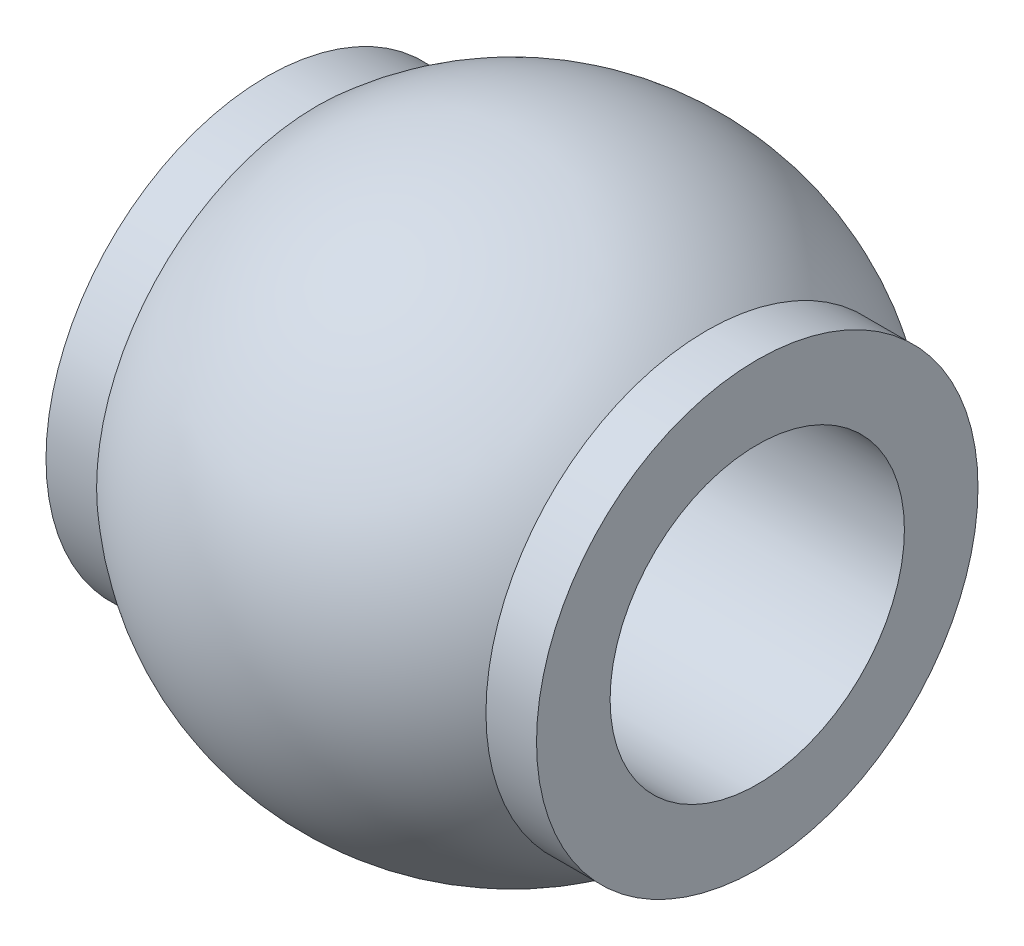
ISO-10303-21;
HEADER;
FILE_DESCRIPTION(('STEP AP214'),'2;1');
FILE_NAME('part.step','',(''),(''),'','','');
FILE_SCHEMA(('AUTOMOTIVE_DESIGN { 1 0 10303 214 1 1 1 1 }'));
ENDSEC;
DATA;
#1=APPLICATION_CONTEXT('core data for automotive mechanical design processes');
#2=APPLICATION_PROTOCOL_DEFINITION('international standard','automotive_design',2000,#1);
#3=PRODUCT_CONTEXT('',#1,'mechanical');
#4=PRODUCT('Part','Part','',(#3));
#5=PRODUCT_RELATED_PRODUCT_CATEGORY('part','',(#4));
#6=PRODUCT_DEFINITION_FORMATION('','',#4);
#7=PRODUCT_DEFINITION_CONTEXT('part definition',#1,'design');
#8=PRODUCT_DEFINITION('design','',#6,#7);
#9=PRODUCT_DEFINITION_SHAPE('','',#8);
#10=(LENGTH_UNIT() NAMED_UNIT(*) SI_UNIT(.MILLI.,.METRE.));
#11=(NAMED_UNIT(*) PLANE_ANGLE_UNIT() SI_UNIT($,.RADIAN.));
#12=(NAMED_UNIT(*) SI_UNIT($,.STERADIAN.) SOLID_ANGLE_UNIT());
#13=UNCERTAINTY_MEASURE_WITH_UNIT(LENGTH_MEASURE(1.E-05),#10,'distance_accuracy_value','');
#14=(GEOMETRIC_REPRESENTATION_CONTEXT(3) GLOBAL_UNCERTAINTY_ASSIGNED_CONTEXT((#13)) GLOBAL_UNIT_ASSIGNED_CONTEXT((#10,
#11,#12)) REPRESENTATION_CONTEXT('',''));
#15=CARTESIAN_POINT('',(0.,0.,0.));
#16=DIRECTION('',(0.,0.,1.));
#17=DIRECTION('',(1.,0.,0.));
#18=AXIS2_PLACEMENT_3D('',#15,#16,#17);
#19=CARTESIAN_POINT('',(-2.5,0.,0.));
#20=DIRECTION('',(1.,0.,0.));
#21=DIRECTION('',(0.,0.,-1.));
#22=AXIS2_PLACEMENT_3D('',#19,#20,#21);
#23=PLANE('',#22);
#24=CARTESIAN_POINT('',(-2.5,0.,0.));
#25=DIRECTION('',(1.,0.,0.));
#26=DIRECTION('',(0.,0.,-1.));
#27=AXIS2_PLACEMENT_3D('',#24,#25,#26);
#28=CIRCLE('',#27,1.5);
#29=CARTESIAN_POINT('',(-2.5,0.,-1.5));
#30=VERTEX_POINT('',#29);
#31=EDGE_CURVE('E367',#30,#30,#28,.T.);
#32=ORIENTED_EDGE('',*,*,#31,.T.);
#33=EDGE_LOOP('',(#32));
#34=FACE_BOUND('',#33,.T.);
#35=CARTESIAN_POINT('',(-2.5,0.,0.));
#36=DIRECTION('',(-1.,0.,0.));
#37=DIRECTION('',(0.,0.,1.));
#38=AXIS2_PLACEMENT_3D('',#35,#36,#37);
#39=CIRCLE('',#38,2.25);
#40=CARTESIAN_POINT('',(-2.5,0.,2.25));
#41=VERTEX_POINT('',#40);
#42=EDGE_CURVE('E362',#41,#41,#39,.T.);
#43=ORIENTED_EDGE('',*,*,#42,.T.);
#44=EDGE_LOOP('',(#43));
#45=FACE_BOUND('',#44,.T.);
#46=ADVANCED_FACE('F348',(#34,#45),#23,.F.);
#47=CARTESIAN_POINT('',(2.5,0.,0.));
#48=DIRECTION('',(-1.,0.,0.));
#49=DIRECTION('',(0.,0.,1.));
#50=AXIS2_PLACEMENT_3D('',#47,#48,#49);
#51=PLANE('',#50);
#52=CARTESIAN_POINT('',(2.5,0.,0.));
#53=DIRECTION('',(1.,0.,0.));
#54=DIRECTION('',(0.,0.,-1.));
#55=AXIS2_PLACEMENT_3D('',#52,#53,#54);
#56=CIRCLE('',#55,1.5);
#57=CARTESIAN_POINT('',(2.5,0.,-1.5));
#58=VERTEX_POINT('',#57);
#59=EDGE_CURVE('E370',#58,#58,#56,.T.);
#60=ORIENTED_EDGE('',*,*,#59,.F.);
#61=EDGE_LOOP('',(#60));
#62=FACE_BOUND('',#61,.T.);
#63=CARTESIAN_POINT('',(2.5,0.,0.));
#64=DIRECTION('',(-1.,0.,0.));
#65=DIRECTION('',(0.,0.,1.));
#66=AXIS2_PLACEMENT_3D('',#63,#64,#65);
#67=CIRCLE('',#66,2.25);
#68=CARTESIAN_POINT('',(2.5,0.,2.25));
#69=VERTEX_POINT('',#68);
#70=EDGE_CURVE('E10',#69,#69,#67,.T.);
#71=ORIENTED_EDGE('',*,*,#70,.F.);
#72=EDGE_LOOP('',(#71));
#73=FACE_BOUND('',#72,.T.);
#74=ADVANCED_FACE('F376',(#62,#73),#51,.F.);
#75=CARTESIAN_POINT('',(-3.63983554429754,0.,0.));
#76=DIRECTION('',(-1.,0.,0.));
#77=DIRECTION('',(0.,0.,1.));
#78=AXIS2_PLACEMENT_3D('',#75,#76,#77);
#79=CYLINDRICAL_SURFACE('',#78,2.25);
#80=CARTESIAN_POINT('',(1.98431348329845,0.,0.));
#81=DIRECTION('',(-1.,0.,0.));
#82=DIRECTION('',(0.,0.,1.));
#83=AXIS2_PLACEMENT_3D('',#80,#81,#82);
#84=CIRCLE('',#83,2.25);
#85=CARTESIAN_POINT('',(1.98431348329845,2.25,0.));
#86=VERTEX_POINT('',#85);
#87=EDGE_CURVE('E354',#86,#86,#84,.T.);
#88=ORIENTED_EDGE('',*,*,#87,.F.);
#89=EDGE_LOOP('',(#88));
#90=FACE_BOUND('',#89,.T.);
#91=ORIENTED_EDGE('',*,*,#70,.T.);
#92=EDGE_LOOP('',(#91));
#93=FACE_BOUND('',#92,.T.);
#94=ADVANCED_FACE('F379',(#90,#93),#79,.T.);
#95=CARTESIAN_POINT('',(0.,0.,0.));
#96=DIRECTION('',(-1.,0.,0.));
#97=DIRECTION('',(0.,1.,0.));
#98=AXIS2_PLACEMENT_3D('',#95,#96,#97);
#99=SPHERICAL_SURFACE('',#98,3.);
#100=CARTESIAN_POINT('',(-1.98431348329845,0.,0.));
#101=DIRECTION('',(-1.,0.,0.));
#102=DIRECTION('',(0.,0.,1.));
#103=AXIS2_PLACEMENT_3D('',#100,#101,#102);
#104=CIRCLE('',#103,2.25);
#105=CARTESIAN_POINT('',(-1.98431348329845,2.25,0.));
#106=VERTEX_POINT('',#105);
#107=EDGE_CURVE('E358',#106,#106,#104,.T.);
#108=CARTESIAN_POINT('',(-1.98431348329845,2.25,0.));
#109=CARTESIAN_POINT('',(-1.95043578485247,2.27987831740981,0.));
#110=CARTESIAN_POINT('',(-1.91588235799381,2.30899034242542,0.));
#111=CARTESIAN_POINT('',(-1.84549659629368,2.36562497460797,0.));
#112=CARTESIAN_POINT('',(-1.80966426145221,2.39314758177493,0.));
#113=CARTESIAN_POINT('',(-1.73679323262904,2.44654654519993,0.));
#114=CARTESIAN_POINT('',(-1.69975453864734,2.47242290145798,0.));
#115=CARTESIAN_POINT('',(-1.62454650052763,2.52247675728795,0.));
#116=CARTESIAN_POINT('',(-1.58637715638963,2.54665425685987,0.));
#117=CARTESIAN_POINT('',(-1.50898564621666,2.59326102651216,0.));
#118=CARTESIAN_POINT('',(-1.46976348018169,2.61569029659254,0.));
#119=CARTESIAN_POINT('',(-1.39034635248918,2.65875486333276,0.));
#120=CARTESIAN_POINT('',(-1.35015139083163,2.67939015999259,0.));
#121=CARTESIAN_POINT('',(-1.26887066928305,2.71882467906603,0.));
#122=CARTESIAN_POINT('',(-1.22778490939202,2.73762390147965,0.));
#123=CARTESIAN_POINT('',(-1.14480640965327,2.77334792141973,0.));
#124=CARTESIAN_POINT('',(-1.10291366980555,2.79027271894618,0.));
#125=CARTESIAN_POINT('',(-1.01840667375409,2.82221336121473,0.));
#126=CARTESIAN_POINT('',(-0.975792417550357,2.83722920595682,0.));
#127=CARTESIAN_POINT('',(-0.889929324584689,2.86532130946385,0.));
#128=CARTESIAN_POINT('',(-0.846680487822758,2.87839756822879,0.));
#129=CARTESIAN_POINT('',(-0.759636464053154,2.90258382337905,0.));
#130=CARTESIAN_POINT('',(-0.715841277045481,2.91369381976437,0.));
#131=CARTESIAN_POINT('',(-0.62779389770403,2.93392488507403,0.));
#132=CARTESIAN_POINT('',(-0.583541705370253,2.94304595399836,0.));
#133=CARTESIAN_POINT('',(-0.494670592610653,2.9592805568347,0.));
#134=CARTESIAN_POINT('',(-0.45005167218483,2.96639409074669,0.));
#135=CARTESIAN_POINT('',(-0.360538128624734,2.9785991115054,0.));
#136=CARTESIAN_POINT('',(-0.315643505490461,2.98369059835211,0.));
#137=CARTESIAN_POINT('',(-0.225670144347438,2.99184113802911,0.));
#138=CARTESIAN_POINT('',(-0.18059140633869,2.99490019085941,0.));
#139=CARTESIAN_POINT('',(-0.0903417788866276,2.99897962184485,0.));
#140=CARTESIAN_POINT('',(-0.0451708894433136,3.,0.));
#141=CARTESIAN_POINT('',(0.0451708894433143,3.,0.));
#142=CARTESIAN_POINT('',(0.0903417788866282,2.99897962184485,0.));
#143=CARTESIAN_POINT('',(0.180591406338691,2.99490019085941,0.));
#144=CARTESIAN_POINT('',(0.225670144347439,2.99184113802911,0.));
#145=CARTESIAN_POINT('',(0.315643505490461,2.98369059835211,0.));
#146=CARTESIAN_POINT('',(0.360538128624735,2.9785991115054,0.));
#147=CARTESIAN_POINT('',(0.450051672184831,2.96639409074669,0.));
#148=CARTESIAN_POINT('',(0.494670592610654,2.95928055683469,0.));
#149=CARTESIAN_POINT('',(0.583541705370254,2.94304595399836,0.));
#150=CARTESIAN_POINT('',(0.627793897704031,2.93392488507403,0.));
#151=CARTESIAN_POINT('',(0.715841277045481,2.91369381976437,0.));
#152=CARTESIAN_POINT('',(0.759636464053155,2.90258382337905,0.));
#153=CARTESIAN_POINT('',(0.846680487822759,2.87839756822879,0.));
#154=CARTESIAN_POINT('',(0.889929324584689,2.86532130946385,0.));
#155=CARTESIAN_POINT('',(0.975792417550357,2.83722920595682,0.));
#156=CARTESIAN_POINT('',(1.01840667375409,2.82221336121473,0.));
#157=CARTESIAN_POINT('',(1.10291366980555,2.79027271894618,0.));
#158=CARTESIAN_POINT('',(1.14480640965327,2.77334792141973,0.));
#159=CARTESIAN_POINT('',(1.22778490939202,2.73762390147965,0.));
#160=CARTESIAN_POINT('',(1.26887066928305,2.71882467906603,0.));
#161=CARTESIAN_POINT('',(1.35015139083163,2.67939015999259,0.));
#162=CARTESIAN_POINT('',(1.39034635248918,2.65875486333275,0.));
#163=CARTESIAN_POINT('',(1.4697634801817,2.61569029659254,0.));
#164=CARTESIAN_POINT('',(1.50898564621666,2.59326102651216,0.));
#165=CARTESIAN_POINT('',(1.58637715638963,2.54665425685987,0.));
#166=CARTESIAN_POINT('',(1.62454650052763,2.52247675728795,0.));
#167=CARTESIAN_POINT('',(1.69975453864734,2.47242290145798,0.));
#168=CARTESIAN_POINT('',(1.73679323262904,2.44654654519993,0.));
#169=CARTESIAN_POINT('',(1.80966426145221,2.39314758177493,0.));
#170=CARTESIAN_POINT('',(1.84549659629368,2.36562497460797,0.));
#171=CARTESIAN_POINT('',(1.91588235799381,2.30899034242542,0.));
#172=CARTESIAN_POINT('',(1.95043578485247,2.27987831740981,0.));
#173=CARTESIAN_POINT('',(1.98431348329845,2.25,0.));
#174=B_SPLINE_CURVE_WITH_KNOTS('',3,(#108,#109,#110,#111,#112,#113,#114,#115,#116,#117,#118,
#119,#120,#121,#122,#123,#124,#125,#126,#127,#128,#129,#130,#131,#132,#133,#134,#135,#136,#137,
#138,#139,#140,#141,#142,#143,#144,#145,#146,#147,#148,#149,#150,#151,#152,#153,#154,#155,#156,
#157,#158,#159,#160,#161,#162,#163,#164,#165,#166,#167,#168,#169,#170,#171,#172,#173),
.UNSPECIFIED.,.F.,.F.,(4,2,2,2,2,2,2,2,2,2,2,2,2,2,2,2,2,2,2,2,2,2,2,2,2,2,2,2,2,2,2,2,4),(0.,
0.135501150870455,0.271002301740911,0.406503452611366,0.542004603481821,0.677505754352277,
0.813006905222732,0.948508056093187,1.08400920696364,1.2195103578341,1.35501150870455,
1.49051265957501,1.62601381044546,1.76151496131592,1.89701611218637,2.03251726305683,
2.16801841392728,2.30351956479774,2.43902071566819,2.57452186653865,2.7100230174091,
2.84552416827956,2.98102531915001,3.11652647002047,3.25202762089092,3.38752877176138,
3.52302992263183,3.65853107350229,3.79403222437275,3.9295333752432,4.06503452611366,
4.20053567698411,4.33603682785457),.UNSPECIFIED.);
#175=EDGE_CURVE('BSEAM384',#106,#86,#174,.T.);
#176=ORIENTED_EDGE('',*,*,#107,.F.);
#177=ORIENTED_EDGE('',*,*,#87,.T.);
#178=ORIENTED_EDGE('',*,*,#175,.T.);
#179=ORIENTED_EDGE('',*,*,#175,.F.);
#180=EDGE_LOOP('',(#176,#178,#177,#179));
#181=FACE_BOUND('',#180,.T.);
#182=ADVANCED_FACE('F384',(#181),#99,.T.);
#183=CARTESIAN_POINT('',(-3.63983554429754,0.,0.));
#184=DIRECTION('',(-1.,0.,0.));
#185=DIRECTION('',(0.,0.,1.));
#186=AXIS2_PLACEMENT_3D('',#183,#184,#185);
#187=CYLINDRICAL_SURFACE('',#186,2.25);
#188=ORIENTED_EDGE('',*,*,#42,.F.);
#189=EDGE_LOOP('',(#188));
#190=FACE_BOUND('',#189,.T.);
#191=ORIENTED_EDGE('',*,*,#107,.T.);
#192=EDGE_LOOP('',(#191));
#193=FACE_BOUND('',#192,.T.);
#194=ADVANCED_FACE('F391',(#190,#193),#187,.T.);
#195=CARTESIAN_POINT('',(-2.5,0.,0.));
#196=DIRECTION('',(1.,0.,0.));
#197=DIRECTION('',(0.,0.,-1.));
#198=AXIS2_PLACEMENT_3D('',#195,#196,#197);
#199=CYLINDRICAL_SURFACE('',#198,1.5);
#200=CARTESIAN_POINT('',(-2.5,0.,-1.5));
#201=CARTESIAN_POINT('',(-2.44791666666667,0.,-1.5));
#202=CARTESIAN_POINT('',(-2.39583333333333,0.,-1.5));
#203=CARTESIAN_POINT('',(-2.29166666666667,0.,-1.5));
#204=CARTESIAN_POINT('',(-2.23958333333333,0.,-1.5));
#205=CARTESIAN_POINT('',(-2.13541666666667,0.,-1.5));
#206=CARTESIAN_POINT('',(-2.08333333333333,0.,-1.5));
#207=CARTESIAN_POINT('',(-1.97916666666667,0.,-1.5));
#208=CARTESIAN_POINT('',(-1.92708333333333,0.,-1.5));
#209=CARTESIAN_POINT('',(-1.82291666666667,0.,-1.5));
#210=CARTESIAN_POINT('',(-1.77083333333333,0.,-1.5));
#211=CARTESIAN_POINT('',(-1.66666666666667,0.,-1.5));
#212=CARTESIAN_POINT('',(-1.61458333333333,0.,-1.5));
#213=CARTESIAN_POINT('',(-1.51041666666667,0.,-1.5));
#214=CARTESIAN_POINT('',(-1.45833333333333,0.,-1.5));
#215=CARTESIAN_POINT('',(-1.35416666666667,0.,-1.5));
#216=CARTESIAN_POINT('',(-1.30208333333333,0.,-1.5));
#217=CARTESIAN_POINT('',(-1.19791666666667,0.,-1.5));
#218=CARTESIAN_POINT('',(-1.14583333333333,0.,-1.5));
#219=CARTESIAN_POINT('',(-1.04166666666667,0.,-1.5));
#220=CARTESIAN_POINT('',(-0.989583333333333,0.,-1.5));
#221=CARTESIAN_POINT('',(-0.885416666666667,0.,-1.5));
#222=CARTESIAN_POINT('',(-0.833333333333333,0.,-1.5));
#223=CARTESIAN_POINT('',(-0.729166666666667,0.,-1.5));
#224=CARTESIAN_POINT('',(-0.677083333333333,0.,-1.5));
#225=CARTESIAN_POINT('',(-0.572916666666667,0.,-1.5));
#226=CARTESIAN_POINT('',(-0.520833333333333,0.,-1.5));
#227=CARTESIAN_POINT('',(-0.416666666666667,0.,-1.5));
#228=CARTESIAN_POINT('',(-0.364583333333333,0.,-1.5));
#229=CARTESIAN_POINT('',(-0.260416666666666,0.,-1.5));
#230=CARTESIAN_POINT('',(-0.208333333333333,0.,-1.5));
#231=CARTESIAN_POINT('',(-0.104166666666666,0.,-1.5));
#232=CARTESIAN_POINT('',(-0.0520833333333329,0.,-1.5));
#233=CARTESIAN_POINT('',(0.0520833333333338,0.,-1.5));
#234=CARTESIAN_POINT('',(0.104166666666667,0.,-1.5));
#235=CARTESIAN_POINT('',(0.208333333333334,0.,-1.5));
#236=CARTESIAN_POINT('',(0.260416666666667,0.,-1.5));
#237=CARTESIAN_POINT('',(0.364583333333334,0.,-1.5));
#238=CARTESIAN_POINT('',(0.416666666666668,0.,-1.5));
#239=CARTESIAN_POINT('',(0.520833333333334,0.,-1.5));
#240=CARTESIAN_POINT('',(0.572916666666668,0.,-1.5));
#241=CARTESIAN_POINT('',(0.677083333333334,0.,-1.5));
#242=CARTESIAN_POINT('',(0.729166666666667,0.,-1.5));
#243=CARTESIAN_POINT('',(0.833333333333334,0.,-1.5));
#244=CARTESIAN_POINT('',(0.885416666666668,0.,-1.5));
#245=CARTESIAN_POINT('',(0.989583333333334,0.,-1.5));
#246=CARTESIAN_POINT('',(1.04166666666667,0.,-1.5));
#247=CARTESIAN_POINT('',(1.14583333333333,0.,-1.5));
#248=CARTESIAN_POINT('',(1.19791666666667,0.,-1.5));
#249=CARTESIAN_POINT('',(1.30208333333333,0.,-1.5));
#250=CARTESIAN_POINT('',(1.35416666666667,0.,-1.5));
#251=CARTESIAN_POINT('',(1.45833333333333,0.,-1.5));
#252=CARTESIAN_POINT('',(1.51041666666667,0.,-1.5));
#253=CARTESIAN_POINT('',(1.61458333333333,0.,-1.5));
#254=CARTESIAN_POINT('',(1.66666666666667,0.,-1.5));
#255=CARTESIAN_POINT('',(1.77083333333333,0.,-1.5));
#256=CARTESIAN_POINT('',(1.82291666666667,0.,-1.5));
#257=CARTESIAN_POINT('',(1.92708333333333,0.,-1.5));
#258=CARTESIAN_POINT('',(1.97916666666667,0.,-1.5));
#259=CARTESIAN_POINT('',(2.08333333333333,0.,-1.5));
#260=CARTESIAN_POINT('',(2.13541666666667,0.,-1.5));
#261=CARTESIAN_POINT('',(2.23958333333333,0.,-1.5));
#262=CARTESIAN_POINT('',(2.29166666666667,0.,-1.5));
#263=CARTESIAN_POINT('',(2.39583333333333,0.,-1.5));
#264=CARTESIAN_POINT('',(2.44791666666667,0.,-1.5));
#265=CARTESIAN_POINT('',(2.5,0.,-1.5));
#266=B_SPLINE_CURVE_WITH_KNOTS('',3,(#200,#201,#202,#203,#204,#205,#206,#207,#208,#209,#210,
#211,#212,#213,#214,#215,#216,#217,#218,#219,#220,#221,#222,#223,#224,#225,#226,#227,#228,#229,
#230,#231,#232,#233,#234,#235,#236,#237,#238,#239,#240,#241,#242,#243,#244,#245,#246,#247,#248,
#249,#250,#251,#252,#253,#254,#255,#256,#257,#258,#259,#260,#261,#262,#263,#264,#265),
.UNSPECIFIED.,.F.,.F.,(4,2,2,2,2,2,2,2,2,2,2,2,2,2,2,2,2,2,2,2,2,2,2,2,2,2,2,2,2,2,2,2,4),(0.,
0.15625,0.3125,0.46875,0.625,0.78125,0.9375,1.09375,1.25,1.40625,1.5625,1.71875,1.875,2.03125,
2.1875,2.34375,2.5,2.65625,2.8125,2.96875,3.125,3.28125,3.4375,3.59375,3.75,3.90625,4.0625,
4.21875,4.375,4.53125,4.6875,4.84375,5.),.UNSPECIFIED.);
#267=EDGE_CURVE('BSEAM374',#30,#58,#266,.T.);
#268=ORIENTED_EDGE('',*,*,#31,.F.);
#269=ORIENTED_EDGE('',*,*,#59,.T.);
#270=ORIENTED_EDGE('',*,*,#267,.T.);
#271=ORIENTED_EDGE('',*,*,#267,.F.);
#272=EDGE_LOOP('',(#268,#270,#269,#271));
#273=FACE_BOUND('',#272,.T.);
#274=ADVANCED_FACE('F374',(#273),#199,.F.);
#275=CLOSED_SHELL('',(#46,#74,#94,#182,#194,#274));
#276=MANIFOLD_SOLID_BREP('B2',#275);
#277=ADVANCED_BREP_SHAPE_REPRESENTATION('',(#18,#276),#14);
#278=SHAPE_DEFINITION_REPRESENTATION(#9,#277);
ENDSEC;
END-ISO-10303-21;
